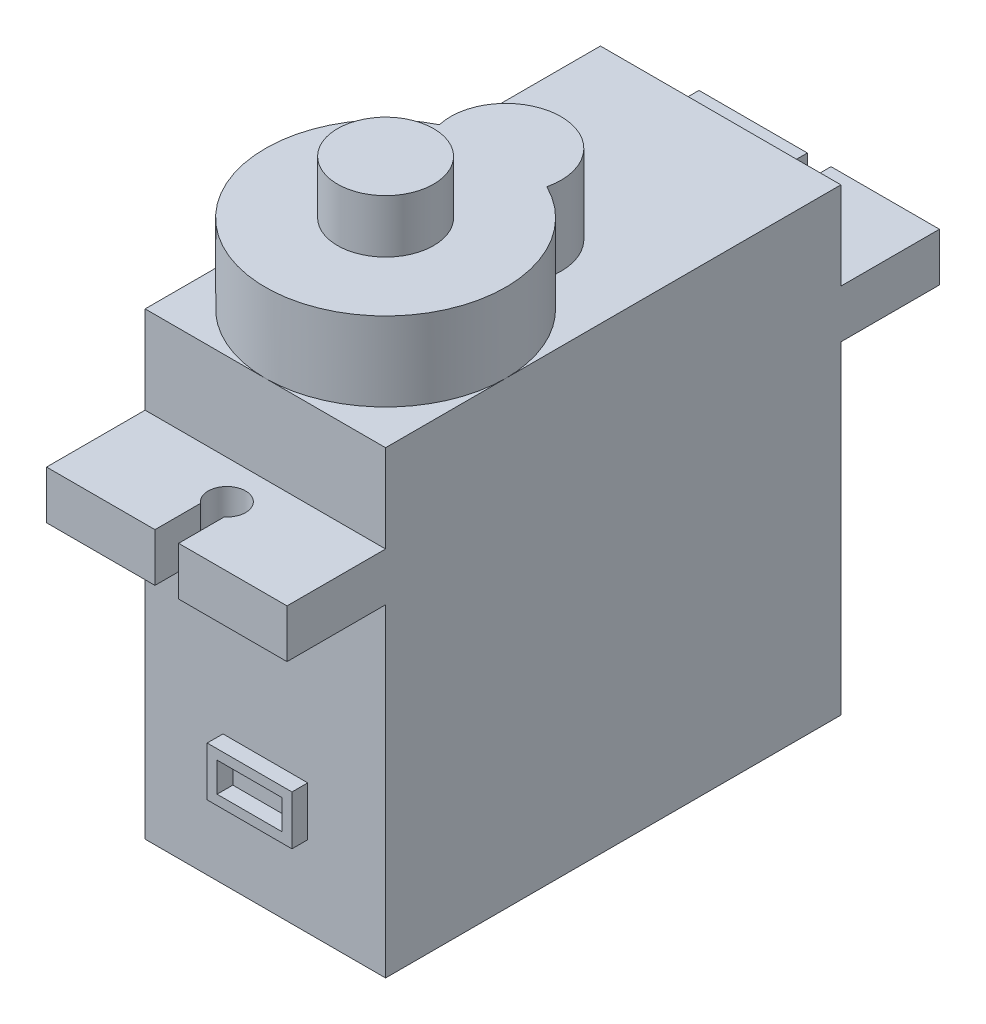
from build123d import *

# Parameters (mm, degrees)
BOSS_EXTRU_1_DEPTH      = 12.2
BOSS_EXTRU_2_DEPTH      = 4
ESQUISSE3_R             = 2.44
BOSS_EXTRU_3_DEPTH      = 2.7
ESQUISSE4_W             = 4.3
ESQUISSE4_H             = 2.5
ESQUISSE4_W_2           = 3.3
ESQUISSE4_H_2           = 1.5
BOSS_EXTRU_4_DEPTH      = 0.8
ENL_V_MAT_EXTRU_3_DEPTH = 2.5


with BuildPart() as part:
    # Esquisse1 → Boss.-Extru.1 (new body)
    with BuildSketch(Plane(origin=(0, 0, 0), x_dir=(0, 0, -1), z_dir=(1, 0, 0))):
        Polygon((23.1, 23.3), (23.1, 18.85), (28.1, 18.85), (28.1, 16.4), (23.1, 16.4), (23.1, 0), (0, 0), (0, 16.4), (-5, 16.4), (-5, 18.85), (0, 18.85), (0, 23.3), align=None)
    extrude(amount=BOSS_EXTRU_1_DEPTH)

    # Esquisse2 → Boss.-Extru.2 (add)
    with BuildSketch(Plane(origin=(0, 23.3, 0), x_dir=(1, 0, 0), z_dir=(0, 1, 0))):
        with BuildLine():
            ThreePointArc((3.37474116, 11.557377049), (6.1, 0), (8.82525884, 11.557377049))
            ThreePointArc((8.82525884, 11.557377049), (6.1, 15), (3.37474116, 11.557377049))
        make_face()
    extrude(amount=BOSS_EXTRU_2_DEPTH)

    # Esquisse3 → Boss.-Extru.3 (add)
    with BuildSketch(Plane(origin=(0, 27.3, 0), x_dir=(1, 0, 0), z_dir=(0, 1, 0))):
        with Locations(Location((6.1, 6.1, 0), (0, 0, 90))):
            Circle(ESQUISSE3_R)
    extrude(amount=BOSS_EXTRU_3_DEPTH)

    # Esquisse4 → Boss.-Extru.4 (add)
    with BuildSketch(Plane.XY):
        with Locations((6.1, 5.35)):
            Rectangle(ESQUISSE4_W, ESQUISSE4_H)
        with Locations((6.1, 5.35)):
            Rectangle(ESQUISSE4_W_2, ESQUISSE4_H_2, mode=Mode.SUBTRACT)
    extrude(amount=BOSS_EXTRU_4_DEPTH)

    # Esquisse5 → Enl_v. mat.-Extru.3 (cut)
    with BuildSketch(Plane(origin=(0, 18.85, 0), x_dir=(1, 0, 0), z_dir=(0, 1, 0))):
        with BuildLine():
            Line((5.5, -2.686545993), (5.5, -5))
            Line((5.5, -5), (6.7, -5))
            Line((6.7, -5), (6.7, -2.686545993))
            ThreePointArc((6.7, -2.686545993), (6.1, -1), (5.5, -2.686545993))
        make_face()
        with BuildLine():
            Line((5.5, 25.786545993), (5.5, 28.1))
            Line((5.5, 28.1), (6.7, 28.1))
            Line((6.7, 28.1), (6.7, 25.786545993))
            ThreePointArc((6.7, 25.786545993), (6.1, 24.1), (5.5, 25.786545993))
        make_face()
    extrude(amount=-ENL_V_MAT_EXTRU_3_DEPTH, mode=Mode.SUBTRACT)


solid = part.part
